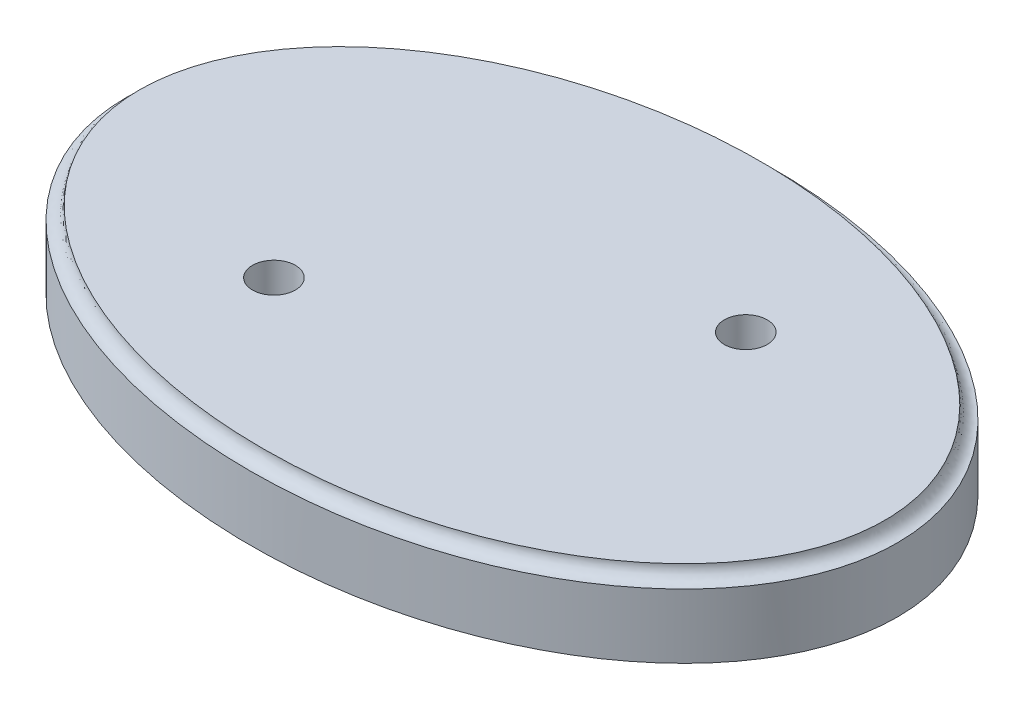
from build123d import *

# Parameters (mm, degrees)
SKETCH1_RX                      = 44.95
SKETCH1_RY                      = 30.5
BOSS_EXTRUDE1_DEPTH             = 9
SKETCH3_R                       = 1.5
F_4_0MM_DOWEL_HOLE1_D           = 4
F_4_0MM_DOWEL_HOLE1_DEPTH       = 6
F_4_0MM_DOWEL_HOLE1_CSINK_D     = 5
F_4_0MM_DOWEL_HOLE1_CSINK_ANGLE = 90
F_4_0MM_DOWEL_HOLE1_TIP         = 1.201721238
F_5_0MM_DOWEL_HOLE1_D           = 5
F_5_0MM_DOWEL_HOLE1_CSINK_D     = 8
F_5_0MM_DOWEL_HOLE1_CSINK_ANGLE = 90


with BuildPart() as part:
    # Sketch1 → Boss-Extrude1 (new body)
    with BuildSketch(Plane(origin=(0, 0, 0), x_dir=(1, 0, 0), z_dir=(0, 1, 0))):
        with Locations((0, 0)):
            Ellipse(SKETCH1_RX, SKETCH1_RY)
    extrude(amount=-BOSS_EXTRUDE1_DEPTH)

    # Cut-Sweep1: sweep along a path in Sketch2
    with BuildLine(Plane(origin=(0, 0, 0), x_dir=(1, 0, 0), z_dir=(0, 1, 0))) as cut_sweep1_path:
        EllipticalCenterArc((0, 0), 44.95, 30.5, start_angle=0, arc_size=360)
    # Sketch3 → Cut-Sweep1 (sweep, cut)
    with BuildSketch(Plane(origin=(0, 0, 0), x_dir=(0, 0, -1), z_dir=(1, 0, 0))):
        with Locations((-30.5, 0)):
            Circle(SKETCH3_R)
    sweep(path=cut_sweep1_path.line, mode=Mode.SUBTRACT)

    # 4.0mm Dowel Hole1
    with Locations(Plane(origin=(0, -9, 0), x_dir=(-1, 0, 0), z_dir=(0, -1, 0))):
        with Locations((26.75, -15.6), (26.75, 15.2), (-26.75, 15.2), (-26.75, -16.932159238)):
            CounterSinkHole(F_4_0MM_DOWEL_HOLE1_D / 2, F_4_0MM_DOWEL_HOLE1_CSINK_D / 2, depth=F_4_0MM_DOWEL_HOLE1_DEPTH, counter_sink_angle=F_4_0MM_DOWEL_HOLE1_CSINK_ANGLE)
            with Locations((0, 0, -(F_4_0MM_DOWEL_HOLE1_DEPTH + F_4_0MM_DOWEL_HOLE1_TIP / 2))):  # 118° drill point
                Cone(0, F_4_0MM_DOWEL_HOLE1_D / 2, F_4_0MM_DOWEL_HOLE1_TIP, mode=Mode.SUBTRACT)

    # 5.0mm Dowel Hole1 (through all)
    with Locations(Plane(origin=(0, -9, 0), x_dir=(-1, 0, 0), z_dir=(0, -1, 0))):
        with Locations((-16.35, 10.9), (16.65, -11.1)):
            CounterSinkHole(F_5_0MM_DOWEL_HOLE1_D / 2, F_5_0MM_DOWEL_HOLE1_CSINK_D / 2, counter_sink_angle=F_5_0MM_DOWEL_HOLE1_CSINK_ANGLE)


solid = part.part
